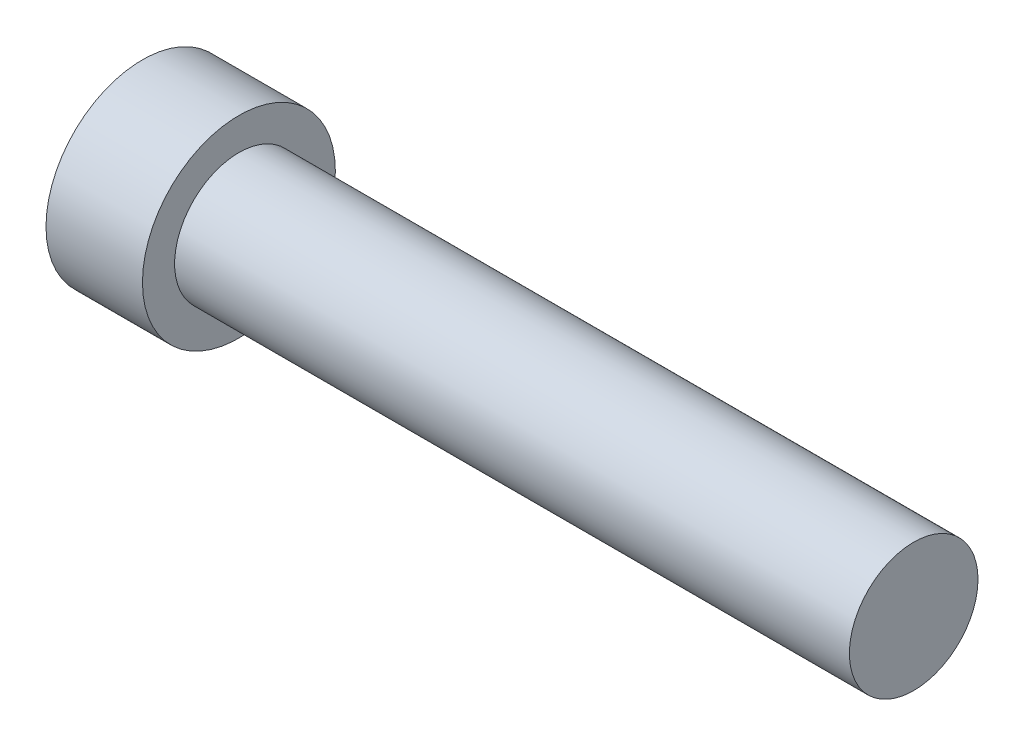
ISO-10303-21;
HEADER;
FILE_DESCRIPTION(('STEP AP214'),'2;1');
FILE_NAME('part.step','',(''),(''),'','','');
FILE_SCHEMA(('AUTOMOTIVE_DESIGN { 1 0 10303 214 1 1 1 1 }'));
ENDSEC;
DATA;
#1=APPLICATION_CONTEXT('core data for automotive mechanical design processes');
#2=APPLICATION_PROTOCOL_DEFINITION('international standard','automotive_design',2000,#1);
#3=PRODUCT_CONTEXT('',#1,'mechanical');
#4=PRODUCT('Part','Part','',(#3));
#5=PRODUCT_RELATED_PRODUCT_CATEGORY('part','',(#4));
#6=PRODUCT_DEFINITION_FORMATION('','',#4);
#7=PRODUCT_DEFINITION_CONTEXT('part definition',#1,'design');
#8=PRODUCT_DEFINITION('design','',#6,#7);
#9=PRODUCT_DEFINITION_SHAPE('','',#8);
#10=(LENGTH_UNIT() NAMED_UNIT(*) SI_UNIT(.MILLI.,.METRE.));
#11=(NAMED_UNIT(*) PLANE_ANGLE_UNIT() SI_UNIT($,.RADIAN.));
#12=(NAMED_UNIT(*) SI_UNIT($,.STERADIAN.) SOLID_ANGLE_UNIT());
#13=UNCERTAINTY_MEASURE_WITH_UNIT(LENGTH_MEASURE(1.E-05),#10,'distance_accuracy_value','');
#14=(GEOMETRIC_REPRESENTATION_CONTEXT(3) GLOBAL_UNCERTAINTY_ASSIGNED_CONTEXT((#13)) GLOBAL_UNIT_ASSIGNED_CONTEXT((#10,
#11,#12)) REPRESENTATION_CONTEXT('',''));
#15=CARTESIAN_POINT('',(0.,0.,0.));
#16=DIRECTION('',(0.,0.,1.));
#17=DIRECTION('',(1.,0.,0.));
#18=AXIS2_PLACEMENT_3D('',#15,#16,#17);
#19=CARTESIAN_POINT('',(15.,0.,0.));
#20=DIRECTION('',(-1.,0.,0.));
#21=DIRECTION('',(0.,0.,1.));
#22=AXIS2_PLACEMENT_3D('',#19,#20,#21);
#23=CYLINDRICAL_SURFACE('',#22,15.);
#24=CARTESIAN_POINT('',(15.,0.,0.));
#25=DIRECTION('',(1.,0.,0.));
#26=DIRECTION('',(0.,0.,-1.));
#27=AXIS2_PLACEMENT_3D('',#24,#25,#26);
#28=CIRCLE('',#27,15.);
#29=CARTESIAN_POINT('',(15.,0.,-15.));
#30=VERTEX_POINT('',#29);
#31=EDGE_CURVE('E51',#30,#30,#28,.T.);
#32=ORIENTED_EDGE('',*,*,#31,.F.);
#33=EDGE_LOOP('',(#32));
#34=FACE_BOUND('',#33,.T.);
#35=CARTESIAN_POINT('',(0.,0.,0.));
#36=DIRECTION('',(1.,0.,0.));
#37=DIRECTION('',(0.,0.,-1.));
#38=AXIS2_PLACEMENT_3D('',#35,#36,#37);
#39=CIRCLE('',#38,15.);
#40=CARTESIAN_POINT('',(0.,0.,-15.));
#41=VERTEX_POINT('',#40);
#42=EDGE_CURVE('E46',#41,#41,#39,.T.);
#43=ORIENTED_EDGE('',*,*,#42,.T.);
#44=EDGE_LOOP('',(#43));
#45=FACE_BOUND('',#44,.T.);
#46=ADVANCED_FACE('F43',(#34,#45),#23,.T.);
#47=CARTESIAN_POINT('',(15.,0.,0.));
#48=DIRECTION('',(1.,0.,0.));
#49=DIRECTION('',(0.,0.,-1.));
#50=AXIS2_PLACEMENT_3D('',#47,#48,#49);
#51=PLANE('',#50);
#52=CARTESIAN_POINT('',(15.,0.,0.));
#53=DIRECTION('',(1.,0.,0.));
#54=DIRECTION('',(0.,0.,-1.));
#55=AXIS2_PLACEMENT_3D('',#52,#53,#54);
#56=CIRCLE('',#55,10.);
#57=CARTESIAN_POINT('',(15.,0.,-10.));
#58=VERTEX_POINT('',#57);
#59=EDGE_CURVE('E10',#58,#58,#56,.T.);
#60=ORIENTED_EDGE('',*,*,#59,.F.);
#61=EDGE_LOOP('',(#60));
#62=FACE_BOUND('',#61,.T.);
#63=ORIENTED_EDGE('',*,*,#31,.T.);
#64=EDGE_LOOP('',(#63));
#65=FACE_BOUND('',#64,.T.);
#66=ADVANCED_FACE('F71',(#62,#65),#51,.T.);
#67=CARTESIAN_POINT('',(0.,0.,0.));
#68=DIRECTION('',(1.,0.,0.));
#69=DIRECTION('',(0.,0.,-1.));
#70=AXIS2_PLACEMENT_3D('',#67,#68,#69);
#71=PLANE('',#70);
#72=ORIENTED_EDGE('',*,*,#42,.F.);
#73=EDGE_LOOP('',(#72));
#74=FACE_BOUND('',#73,.T.);
#75=ADVANCED_FACE('F68',(#74),#71,.F.);
#76=CARTESIAN_POINT('',(119.94,0.,0.));
#77=DIRECTION('',(-1.,0.,0.));
#78=DIRECTION('',(0.,0.,1.));
#79=AXIS2_PLACEMENT_3D('',#76,#77,#78);
#80=CYLINDRICAL_SURFACE('',#79,10.);
#81=CARTESIAN_POINT('',(119.94,0.,0.));
#82=DIRECTION('',(1.,0.,0.));
#83=DIRECTION('',(0.,0.,-1.));
#84=AXIS2_PLACEMENT_3D('',#81,#82,#83);
#85=CIRCLE('',#84,10.);
#86=CARTESIAN_POINT('',(119.94,0.,-10.));
#87=VERTEX_POINT('',#86);
#88=EDGE_CURVE('E58',#87,#87,#85,.T.);
#89=ORIENTED_EDGE('',*,*,#88,.F.);
#90=EDGE_LOOP('',(#89));
#91=FACE_BOUND('',#90,.T.);
#92=ORIENTED_EDGE('',*,*,#59,.T.);
#93=EDGE_LOOP('',(#92));
#94=FACE_BOUND('',#93,.T.);
#95=ADVANCED_FACE('F70',(#91,#94),#80,.T.);
#96=CARTESIAN_POINT('',(119.94,0.,0.));
#97=DIRECTION('',(1.,0.,0.));
#98=DIRECTION('',(0.,0.,-1.));
#99=AXIS2_PLACEMENT_3D('',#96,#97,#98);
#100=PLANE('',#99);
#101=ORIENTED_EDGE('',*,*,#88,.T.);
#102=EDGE_LOOP('',(#101));
#103=FACE_BOUND('',#102,.T.);
#104=ADVANCED_FACE('F77',(#103),#100,.T.);
#105=CLOSED_SHELL('',(#46,#66,#75,#95,#104));
#106=MANIFOLD_SOLID_BREP('B2',#105);
#107=ADVANCED_BREP_SHAPE_REPRESENTATION('',(#18,#106),#14);
#108=SHAPE_DEFINITION_REPRESENTATION(#9,#107);
ENDSEC;
END-ISO-10303-21;
